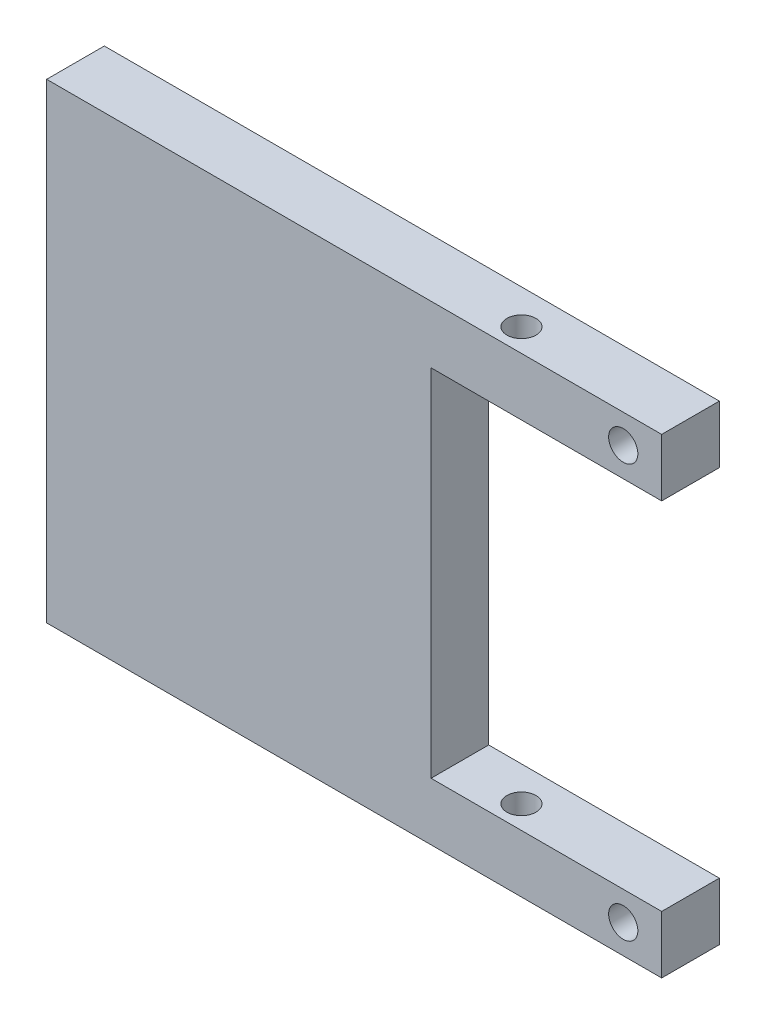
from build123d import *

# Parameters (mm, degrees)
BASE_EXTRUDE_DEPTH = 9.525
SKETCH2_R          = 2.4003
CUT_EXTRUDE1_DEPTH = 129.305125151
SKETCH3_R          = 2.413
CUT_EXTRUDE2_DEPTH = 129.305125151
SKETCH5_R          = 2.413
CUT_EXTRUDE3_DEPTH = 129.305125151


with BuildPart() as part:
    # Sketch1 → Base-Extrude (new body)
    with BuildSketch(Plane.XY):
        Polygon((0, 0), (0, 77.7748), (101.6, 77.7748), (101.6, 68.2498), (63.5, 68.2498), (63.5, 9.525), (101.6, 9.525), (101.6, 0), align=None)
    extrude(amount=BASE_EXTRUDE_DEPTH)

    # Sketch2 → Cut-Extrude1 (cut, through all)
    with BuildSketch(Plane(origin=(0, 77.7748, 0), x_dir=(-1, 0, 0), z_dir=(0, 1, 0))):
        with Locations(Location((-74.6252, 5.715, 0), (0, 0, 90))):
            Circle(SKETCH2_R)
    extrude(amount=-CUT_EXTRUDE1_DEPTH, mode=Mode.SUBTRACT)

    # Sketch3 → Cut-Extrude2 (cut, through all)
    with BuildSketch(Plane(origin=(0, 0, 0), x_dir=(-1, 0, 0), z_dir=(0, 0, -1))):
        with Locations((-95.25, 4.7752)):
            Circle(SKETCH3_R)
    extrude(amount=-CUT_EXTRUDE2_DEPTH, mode=Mode.SUBTRACT)

    # Sketch5 → Cut-Extrude3 (cut, through all)
    with BuildSketch(Plane.XY.offset(9.525)):
        with Locations((95.25, 73.025)):
            Circle(SKETCH5_R)
    extrude(amount=-CUT_EXTRUDE3_DEPTH, mode=Mode.SUBTRACT)


solid = part.part
